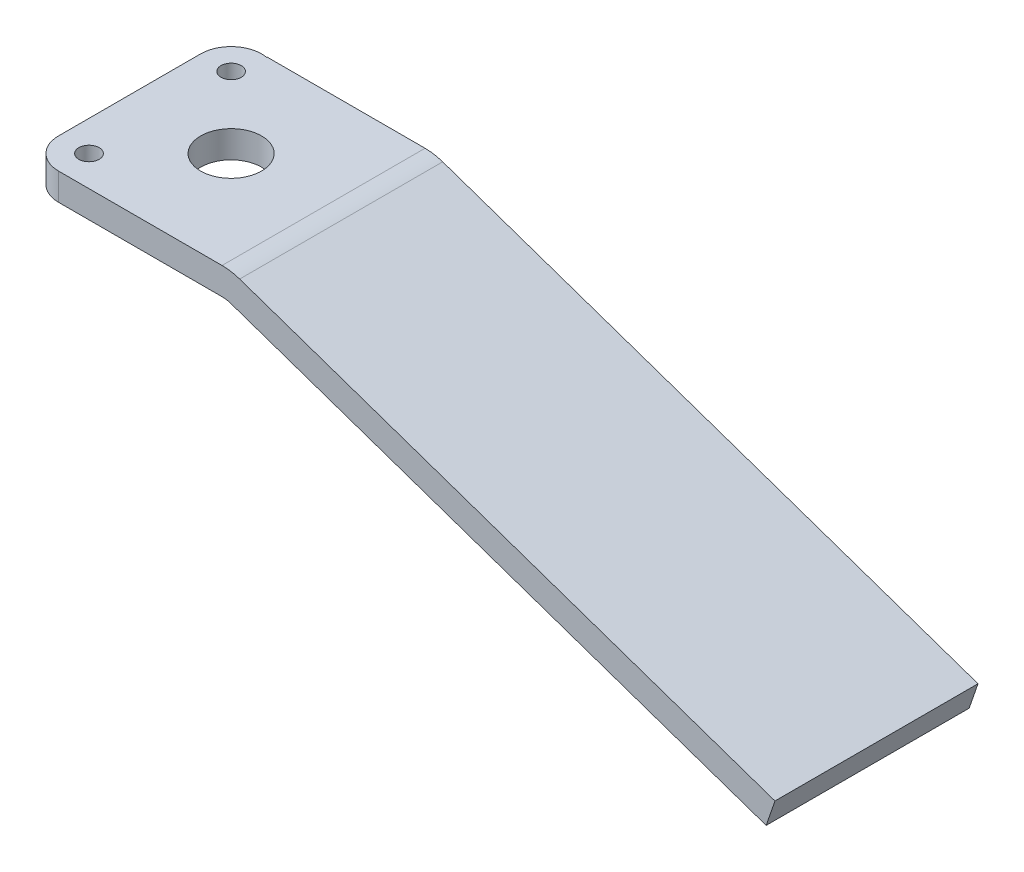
ISO-10303-21;
HEADER;
FILE_DESCRIPTION(('STEP AP214'),'2;1');
FILE_NAME('part.step','',(''),(''),'','','');
FILE_SCHEMA(('AUTOMOTIVE_DESIGN { 1 0 10303 214 1 1 1 1 }'));
ENDSEC;
DATA;
#1=APPLICATION_CONTEXT('core data for automotive mechanical design processes');
#2=APPLICATION_PROTOCOL_DEFINITION('international standard','automotive_design',2000,#1);
#3=PRODUCT_CONTEXT('',#1,'mechanical');
#4=PRODUCT('Part','Part','',(#3));
#5=PRODUCT_RELATED_PRODUCT_CATEGORY('part','',(#4));
#6=PRODUCT_DEFINITION_FORMATION('','',#4);
#7=PRODUCT_DEFINITION_CONTEXT('part definition',#1,'design');
#8=PRODUCT_DEFINITION('design','',#6,#7);
#9=PRODUCT_DEFINITION_SHAPE('','',#8);
#10=(LENGTH_UNIT() NAMED_UNIT(*) SI_UNIT(.MILLI.,.METRE.));
#11=(NAMED_UNIT(*) PLANE_ANGLE_UNIT() SI_UNIT($,.RADIAN.));
#12=(NAMED_UNIT(*) SI_UNIT($,.STERADIAN.) SOLID_ANGLE_UNIT());
#13=UNCERTAINTY_MEASURE_WITH_UNIT(LENGTH_MEASURE(1.E-05),#10,'distance_accuracy_value','');
#14=(GEOMETRIC_REPRESENTATION_CONTEXT(3) GLOBAL_UNCERTAINTY_ASSIGNED_CONTEXT((#13)) GLOBAL_UNIT_ASSIGNED_CONTEXT((#10,
#11,#12)) REPRESENTATION_CONTEXT('',''));
#15=CARTESIAN_POINT('',(0.,0.,0.));
#16=DIRECTION('',(0.,0.,1.));
#17=DIRECTION('',(1.,0.,0.));
#18=AXIS2_PLACEMENT_3D('',#15,#16,#17);
#19=CARTESIAN_POINT('',(-14.3306295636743,0.,15.));
#20=DIRECTION('',(1.,0.,0.));
#21=DIRECTION('',(0.,0.,-1.));
#22=AXIS2_PLACEMENT_3D('',#19,#20,#21);
#23=PLANE('',#22);
#24=DIRECTION('',(0.,1.,0.));
#25=VECTOR('',#24,1.);
#26=CARTESIAN_POINT('',(-14.3306295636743,-31.4553674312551,-10.5));
#27=LINE('',#26,#25);
#28=CARTESIAN_POINT('',(-14.3306295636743,-4.00000000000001,-10.5));
#29=VERTEX_POINT('',#28);
#30=CARTESIAN_POINT('',(-14.3306295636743,0.,-10.5));
#31=VERTEX_POINT('',#30);
#32=EDGE_CURVE('E116',#29,#31,#27,.T.);
#33=ORIENTED_EDGE('',*,*,#32,.F.);
#34=DIRECTION('',(0.,0.,-1.));
#35=VECTOR('',#34,1.);
#36=CARTESIAN_POINT('',(-14.3306295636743,-4.,15.));
#37=LINE('',#36,#35);
#38=CARTESIAN_POINT('',(-14.3306295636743,-4.00000000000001,10.5));
#39=VERTEX_POINT('',#38);
#40=EDGE_CURVE('E37',#39,#29,#37,.T.);
#41=ORIENTED_EDGE('',*,*,#40,.F.);
#42=DIRECTION('',(0.,1.,0.));
#43=VECTOR('',#42,1.);
#44=CARTESIAN_POINT('',(-14.3306295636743,-31.4553674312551,10.5));
#45=LINE('',#44,#43);
#46=CARTESIAN_POINT('',(-14.3306295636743,0.,10.5));
#47=VERTEX_POINT('',#46);
#48=EDGE_CURVE('E282',#39,#47,#45,.T.);
#49=ORIENTED_EDGE('',*,*,#48,.T.);
#50=DIRECTION('',(0.,0.,-1.));
#51=VECTOR('',#50,1.);
#52=CARTESIAN_POINT('',(-14.3306295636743,0.,15.));
#53=LINE('',#52,#51);
#54=EDGE_CURVE('E231',#47,#31,#53,.T.);
#55=ORIENTED_EDGE('',*,*,#54,.T.);
#56=EDGE_LOOP('',(#33,#41,#49,#55));
#57=FACE_BOUND('',#56,.T.);
#58=ADVANCED_FACE('F30',(#57),#23,.F.);
#59=CARTESIAN_POINT('',(14.3306295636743,-4.,15.));
#60=DIRECTION('',(0.,-1.,0.));
#61=DIRECTION('',(1.,0.,0.));
#62=AXIS2_PLACEMENT_3D('',#59,#60,#61);
#63=PLANE('',#62);
#64=CARTESIAN_POINT('',(0.669370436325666,-4.,0.));
#65=DIRECTION('',(0.,-1.,0.));
#66=DIRECTION('',(1.,0.,0.));
#67=AXIS2_PLACEMENT_3D('',#64,#65,#66);
#68=CIRCLE('',#67,4.5);
#69=CARTESIAN_POINT('',(5.16937043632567,-4.,0.));
#70=VERTEX_POINT('',#69);
#71=EDGE_CURVE('E203',#70,#70,#68,.T.);
#72=ORIENTED_EDGE('',*,*,#71,.F.);
#73=EDGE_LOOP('',(#72));
#74=FACE_BOUND('',#73,.T.);
#75=CARTESIAN_POINT('',(-9.83062956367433,-4.,10.5));
#76=DIRECTION('',(0.,-1.,0.));
#77=DIRECTION('',(1.,0.,0.));
#78=AXIS2_PLACEMENT_3D('',#75,#76,#77);
#79=CIRCLE('',#78,1.5);
#80=CARTESIAN_POINT('',(-8.33062956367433,-4.,10.5));
#81=VERTEX_POINT('',#80);
#82=EDGE_CURVE('E207',#81,#81,#79,.T.);
#83=ORIENTED_EDGE('',*,*,#82,.F.);
#84=EDGE_LOOP('',(#83));
#85=FACE_BOUND('',#84,.T.);
#86=CARTESIAN_POINT('',(-9.83062956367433,-4.,-10.5));
#87=DIRECTION('',(0.,-1.,0.));
#88=DIRECTION('',(1.,0.,0.));
#89=AXIS2_PLACEMENT_3D('',#86,#87,#88);
#90=CIRCLE('',#89,1.5);
#91=CARTESIAN_POINT('',(-8.33062956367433,-4.,-10.5));
#92=VERTEX_POINT('',#91);
#93=EDGE_CURVE('E211',#92,#92,#90,.T.);
#94=ORIENTED_EDGE('',*,*,#93,.F.);
#95=EDGE_LOOP('',(#94));
#96=FACE_BOUND('',#95,.T.);
#97=ORIENTED_EDGE('',*,*,#40,.T.);
#98=CARTESIAN_POINT('',(-9.83062956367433,-4.,-10.5));
#99=DIRECTION('',(0.,-1.,0.));
#100=DIRECTION('',(1.,0.,0.));
#101=AXIS2_PLACEMENT_3D('',#98,#99,#100);
#102=CIRCLE('',#101,4.5);
#103=CARTESIAN_POINT('',(-8.90100355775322,-4.00000000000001,-14.9029303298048));
#104=VERTEX_POINT('',#103);
#105=EDGE_CURVE('E214',#29,#104,#102,.T.);
#106=ORIENTED_EDGE('',*,*,#105,.T.);
#107=CARTESIAN_POINT('',(-14.3306295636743,-4.,-10.5));
#108=CARTESIAN_POINT('',(-16.5252141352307,-4.,-14.3200295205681));
#109=CARTESIAN_POINT('',(-21.0852108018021,-4.00000000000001,-22.2574415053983));
#110=CARTESIAN_POINT('',(-13.062587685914,-4.,-17.4149047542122));
#111=CARTESIAN_POINT('',(-8.90100355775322,-4.,-14.9029303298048));
#112=B_SPLINE_CURVE_WITH_KNOTS('',3,(#107,#108,#109,#110,#111),.UNSPECIFIED.,.F.,.F.,(4,1,4),
(0.,0.481268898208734,1.),.UNSPECIFIED.);
#113=CARTESIAN_POINT('',(-9.06182367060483,-4.,-15.));
#114=VERTEX_POINT('',#113);
#115=EDGE_CURVE('E124',#104,#114,#112,.F.);
#116=ORIENTED_EDGE('',*,*,#115,.T.);
#117=DIRECTION('',(-1.,0.,0.));
#118=VECTOR('',#117,1.);
#119=CARTESIAN_POINT('',(14.3306295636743,-4.,-15.));
#120=LINE('',#119,#118);
#121=CARTESIAN_POINT('',(14.3306295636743,-4.,-15.));
#122=VERTEX_POINT('',#121);
#123=EDGE_CURVE('E266',#122,#114,#120,.T.);
#124=ORIENTED_EDGE('',*,*,#123,.F.);
#125=DIRECTION('',(0.,0.,-1.));
#126=VECTOR('',#125,1.);
#127=CARTESIAN_POINT('',(14.3306295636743,-4.,15.));
#128=LINE('',#127,#126);
#129=CARTESIAN_POINT('',(14.3306295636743,-4.,15.));
#130=VERTEX_POINT('',#129);
#131=EDGE_CURVE('E217',#130,#122,#128,.T.);
#132=ORIENTED_EDGE('',*,*,#131,.F.);
#133=DIRECTION('',(-1.,0.,0.));
#134=VECTOR('',#133,1.);
#135=CARTESIAN_POINT('',(14.3306295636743,-4.,15.));
#136=LINE('',#135,#134);
#137=CARTESIAN_POINT('',(-9.83062956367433,-4.,15.));
#138=VERTEX_POINT('',#137);
#139=EDGE_CURVE('E249',#130,#138,#136,.T.);
#140=ORIENTED_EDGE('',*,*,#139,.T.);
#141=CARTESIAN_POINT('',(-9.83062956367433,-4.,10.5));
#142=DIRECTION('',(0.,-1.,0.));
#143=DIRECTION('',(1.,0.,0.));
#144=AXIS2_PLACEMENT_3D('',#141,#142,#143);
#145=CIRCLE('',#144,4.5);
#146=EDGE_CURVE('E51',#138,#39,#145,.T.);
#147=ORIENTED_EDGE('',*,*,#146,.T.);
#148=EDGE_LOOP('',(#97,#106,#116,#124,#132,#140,#147));
#149=FACE_BOUND('',#148,.T.);
#150=ADVANCED_FACE('F175',(#74,#85,#96,#149),#63,.T.);
#151=CARTESIAN_POINT('',(-14.3306295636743,0.,15.));
#152=DIRECTION('',(0.,1.,0.));
#153=DIRECTION('',(-1.,0.,0.));
#154=AXIS2_PLACEMENT_3D('',#151,#152,#153);
#155=PLANE('',#154);
#156=CARTESIAN_POINT('',(0.669370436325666,0.,0.));
#157=DIRECTION('',(0.,1.,0.));
#158=DIRECTION('',(-1.,0.,0.));
#159=AXIS2_PLACEMENT_3D('',#156,#157,#158);
#160=CIRCLE('',#159,4.5);
#161=CARTESIAN_POINT('',(-3.83062956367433,0.,0.));
#162=VERTEX_POINT('',#161);
#163=EDGE_CURVE('E270',#162,#162,#160,.T.);
#164=ORIENTED_EDGE('',*,*,#163,.F.);
#165=EDGE_LOOP('',(#164));
#166=FACE_BOUND('',#165,.T.);
#167=CARTESIAN_POINT('',(-9.83062956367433,0.,10.5));
#168=DIRECTION('',(0.,1.,0.));
#169=DIRECTION('',(-1.,0.,0.));
#170=AXIS2_PLACEMENT_3D('',#167,#168,#169);
#171=CIRCLE('',#170,1.5);
#172=CARTESIAN_POINT('',(-11.3306295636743,0.,10.5));
#173=VERTEX_POINT('',#172);
#174=EDGE_CURVE('E274',#173,#173,#171,.T.);
#175=ORIENTED_EDGE('',*,*,#174,.F.);
#176=EDGE_LOOP('',(#175));
#177=FACE_BOUND('',#176,.T.);
#178=CARTESIAN_POINT('',(-9.83062956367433,0.,-10.5));
#179=DIRECTION('',(0.,1.,0.));
#180=DIRECTION('',(-1.,0.,0.));
#181=AXIS2_PLACEMENT_3D('',#178,#179,#180);
#182=CIRCLE('',#181,1.5);
#183=CARTESIAN_POINT('',(-11.3306295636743,0.,-10.5));
#184=VERTEX_POINT('',#183);
#185=EDGE_CURVE('E278',#184,#184,#182,.T.);
#186=ORIENTED_EDGE('',*,*,#185,.F.);
#187=EDGE_LOOP('',(#186));
#188=FACE_BOUND('',#187,.T.);
#189=CARTESIAN_POINT('',(-14.3306295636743,0.,-10.5));
#190=CARTESIAN_POINT('',(-16.5252141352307,0.,-14.3200295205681));
#191=CARTESIAN_POINT('',(-21.0852108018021,0.,-22.2574415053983));
#192=CARTESIAN_POINT('',(-13.062587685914,0.,-17.4149047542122));
#193=CARTESIAN_POINT('',(-8.90100355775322,0.,-14.9029303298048));
#194=B_SPLINE_CURVE_WITH_KNOTS('',3,(#189,#190,#191,#192,#193),.UNSPECIFIED.,.F.,.F.,(4,1,4),
(0.,0.481268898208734,1.),.UNSPECIFIED.);
#195=CARTESIAN_POINT('',(-9.0618236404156,0.,-15.));
#196=VERTEX_POINT('',#195);
#197=CARTESIAN_POINT('',(-8.90100355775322,0.,-14.9029303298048));
#198=VERTEX_POINT('',#197);
#199=EDGE_CURVE('E43',#196,#198,#194,.T.);
#200=ORIENTED_EDGE('',*,*,#199,.T.);
#201=CARTESIAN_POINT('',(-9.83062956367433,0.,-10.5));
#202=DIRECTION('',(0.,1.,0.));
#203=DIRECTION('',(-1.,0.,0.));
#204=AXIS2_PLACEMENT_3D('',#201,#202,#203);
#205=CIRCLE('',#204,4.5);
#206=EDGE_CURVE('E112',#198,#31,#205,.T.);
#207=ORIENTED_EDGE('',*,*,#206,.T.);
#208=ORIENTED_EDGE('',*,*,#54,.F.);
#209=CARTESIAN_POINT('',(-9.83062956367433,0.,10.5));
#210=DIRECTION('',(0.,1.,0.));
#211=DIRECTION('',(-1.,0.,0.));
#212=AXIS2_PLACEMENT_3D('',#209,#210,#211);
#213=CIRCLE('',#212,4.5);
#214=CARTESIAN_POINT('',(-9.83062956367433,0.,15.));
#215=VERTEX_POINT('',#214);
#216=EDGE_CURVE('E286',#47,#215,#213,.T.);
#217=ORIENTED_EDGE('',*,*,#216,.T.);
#218=DIRECTION('',(1.,0.,0.));
#219=VECTOR('',#218,1.);
#220=CARTESIAN_POINT('',(-14.3306295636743,0.,15.));
#221=LINE('',#220,#219);
#222=CARTESIAN_POINT('',(14.3306295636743,0.,15.));
#223=VERTEX_POINT('',#222);
#224=EDGE_CURVE('E233',#215,#223,#221,.T.);
#225=ORIENTED_EDGE('',*,*,#224,.T.);
#226=DIRECTION('',(0.,0.,-1.));
#227=VECTOR('',#226,1.);
#228=CARTESIAN_POINT('',(14.3306295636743,0.,15.));
#229=LINE('',#228,#227);
#230=CARTESIAN_POINT('',(14.3306295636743,0.,-15.));
#231=VERTEX_POINT('',#230);
#232=EDGE_CURVE('E229',#223,#231,#229,.T.);
#233=ORIENTED_EDGE('',*,*,#232,.T.);
#234=DIRECTION('',(1.,0.,0.));
#235=VECTOR('',#234,1.);
#236=CARTESIAN_POINT('',(-14.3306295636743,0.,-15.));
#237=LINE('',#236,#235);
#238=EDGE_CURVE('E129',#196,#231,#237,.T.);
#239=ORIENTED_EDGE('',*,*,#238,.F.);
#240=EDGE_LOOP('',(#200,#207,#208,#217,#225,#233,#239));
#241=FACE_BOUND('',#240,.T.);
#242=ADVANCED_FACE('F127',(#166,#177,#188,#241),#155,.T.);
#243=CARTESIAN_POINT('',(14.3306295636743,-8.00000000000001,-15.));
#244=DIRECTION('',(0.,0.,1.));
#245=DIRECTION('',(1.,0.,0.));
#246=AXIS2_PLACEMENT_3D('',#243,#244,#245);
#247=PLANE('',#246);
#248=DIRECTION('',(0.,1.,0.));
#249=VECTOR('',#248,1.);
#250=CARTESIAN_POINT('',(-9.06182367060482,-31.4553674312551,-15.));
#251=LINE('',#250,#249);
#252=EDGE_CURVE('E11',#196,#114,#251,.F.);
#253=ORIENTED_EDGE('',*,*,#252,.F.);
#254=ORIENTED_EDGE('',*,*,#238,.T.);
#255=CARTESIAN_POINT('',(14.3306295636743,-8.,-15.));
#256=DIRECTION('',(0.,0.,1.));
#257=DIRECTION('',(1.,0.,0.));
#258=AXIS2_PLACEMENT_3D('',#255,#256,#257);
#259=CIRCLE('',#258,8.);
#260=CARTESIAN_POINT('',(16.9351747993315,-0.435851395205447,-15.));
#261=VERTEX_POINT('',#260);
#262=EDGE_CURVE('E252',#261,#231,#259,.T.);
#263=ORIENTED_EDGE('',*,*,#262,.F.);
#264=DIRECTION('',(0.945518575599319,-0.325568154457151,0.));
#265=VECTOR('',#264,1.);
#266=CARTESIAN_POINT('',(16.9351747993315,-0.435851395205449,-15.));
#267=LINE('',#266,#265);
#268=CARTESIAN_POINT('',(96.0384493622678,-27.6732931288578,-15.));
#269=VERTEX_POINT('',#268);
#270=EDGE_CURVE('E255',#261,#269,#267,.T.);
#271=ORIENTED_EDGE('',*,*,#270,.T.);
#272=DIRECTION('',(-0.32556815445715,-0.945518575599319,0.));
#273=VECTOR('',#272,1.);
#274=CARTESIAN_POINT('',(96.0384493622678,-27.6732931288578,-15.));
#275=LINE('',#274,#273);
#276=CARTESIAN_POINT('',(94.7361767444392,-31.4553674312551,-15.));
#277=VERTEX_POINT('',#276);
#278=EDGE_CURVE('E257',#269,#277,#275,.T.);
#279=ORIENTED_EDGE('',*,*,#278,.T.);
#280=DIRECTION('',(0.945518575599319,-0.325568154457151,0.));
#281=VECTOR('',#280,1.);
#282=CARTESIAN_POINT('',(15.6329021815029,-4.21792569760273,-15.));
#283=LINE('',#282,#281);
#284=CARTESIAN_POINT('',(15.6329021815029,-4.21792569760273,-15.));
#285=VERTEX_POINT('',#284);
#286=EDGE_CURVE('E260',#285,#277,#283,.T.);
#287=ORIENTED_EDGE('',*,*,#286,.F.);
#288=CARTESIAN_POINT('',(14.3306295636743,-8.00000000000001,-15.));
#289=DIRECTION('',(0.,0.,1.));
#290=DIRECTION('',(1.,0.,0.));
#291=AXIS2_PLACEMENT_3D('',#288,#289,#290);
#292=CIRCLE('',#291,4.);
#293=EDGE_CURVE('E263',#285,#122,#292,.T.);
#294=ORIENTED_EDGE('',*,*,#293,.T.);
#295=ORIENTED_EDGE('',*,*,#123,.T.);
#296=EDGE_LOOP('',(#253,#254,#263,#271,#279,#287,#294,#295));
#297=FACE_BOUND('',#296,.T.);
#298=ADVANCED_FACE('F164',(#297),#247,.F.);
#299=CARTESIAN_POINT('',(14.3306295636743,-8.00000000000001,15.));
#300=DIRECTION('',(0.,0.,-1.));
#301=DIRECTION('',(-1.,0.,0.));
#302=AXIS2_PLACEMENT_3D('',#299,#300,#301);
#303=CYLINDRICAL_SURFACE('',#302,4.);
#304=ORIENTED_EDGE('',*,*,#293,.F.);
#305=DIRECTION('',(0.,0.,-1.));
#306=VECTOR('',#305,1.);
#307=CARTESIAN_POINT('',(15.6329021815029,-4.21792569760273,15.));
#308=LINE('',#307,#306);
#309=CARTESIAN_POINT('',(15.6329021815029,-4.21792569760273,15.));
#310=VERTEX_POINT('',#309);
#311=EDGE_CURVE('E218',#310,#285,#308,.T.);
#312=ORIENTED_EDGE('',*,*,#311,.F.);
#313=CARTESIAN_POINT('',(14.3306295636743,-8.00000000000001,15.));
#314=DIRECTION('',(0.,0.,1.));
#315=DIRECTION('',(1.,0.,0.));
#316=AXIS2_PLACEMENT_3D('',#313,#314,#315);
#317=CIRCLE('',#316,4.);
#318=EDGE_CURVE('E246',#310,#130,#317,.T.);
#319=ORIENTED_EDGE('',*,*,#318,.T.);
#320=ORIENTED_EDGE('',*,*,#131,.T.);
#321=EDGE_LOOP('',(#304,#312,#319,#320));
#322=FACE_BOUND('',#321,.T.);
#323=ADVANCED_FACE('F167',(#322),#303,.F.);
#324=CARTESIAN_POINT('',(15.6329021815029,-4.21792569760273,15.));
#325=DIRECTION('',(0.325568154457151,0.945518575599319,0.));
#326=DIRECTION('',(-0.945518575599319,0.325568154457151,0.));
#327=AXIS2_PLACEMENT_3D('',#324,#325,#326);
#328=PLANE('',#327);
#329=ORIENTED_EDGE('',*,*,#286,.T.);
#330=DIRECTION('',(0.,0.,-1.));
#331=VECTOR('',#330,1.);
#332=CARTESIAN_POINT('',(94.7361767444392,-31.4553674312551,15.));
#333=LINE('',#332,#331);
#334=CARTESIAN_POINT('',(94.7361767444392,-31.4553674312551,15.));
#335=VERTEX_POINT('',#334);
#336=EDGE_CURVE('E222',#335,#277,#333,.T.);
#337=ORIENTED_EDGE('',*,*,#336,.F.);
#338=DIRECTION('',(0.945518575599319,-0.325568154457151,0.));
#339=VECTOR('',#338,1.);
#340=CARTESIAN_POINT('',(15.6329021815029,-4.21792569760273,15.));
#341=LINE('',#340,#339);
#342=EDGE_CURVE('E244',#310,#335,#341,.T.);
#343=ORIENTED_EDGE('',*,*,#342,.F.);
#344=ORIENTED_EDGE('',*,*,#311,.T.);
#345=EDGE_LOOP('',(#329,#337,#343,#344));
#346=FACE_BOUND('',#345,.T.);
#347=ADVANCED_FACE('F187',(#346),#328,.F.);
#348=CARTESIAN_POINT('',(96.0384493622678,-27.6732931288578,15.));
#349=DIRECTION('',(0.945518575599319,-0.32556815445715,0.));
#350=DIRECTION('',(0.32556815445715,0.945518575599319,0.));
#351=AXIS2_PLACEMENT_3D('',#348,#349,#350);
#352=PLANE('',#351);
#353=ORIENTED_EDGE('',*,*,#278,.F.);
#354=DIRECTION('',(0.,0.,-1.));
#355=VECTOR('',#354,1.);
#356=CARTESIAN_POINT('',(96.0384493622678,-27.6732931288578,15.));
#357=LINE('',#356,#355);
#358=CARTESIAN_POINT('',(96.0384493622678,-27.6732931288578,15.));
#359=VERTEX_POINT('',#358);
#360=EDGE_CURVE('E224',#359,#269,#357,.T.);
#361=ORIENTED_EDGE('',*,*,#360,.F.);
#362=DIRECTION('',(-0.32556815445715,-0.945518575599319,0.));
#363=VECTOR('',#362,1.);
#364=CARTESIAN_POINT('',(96.0384493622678,-27.6732931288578,15.));
#365=LINE('',#364,#363);
#366=EDGE_CURVE('E241',#359,#335,#365,.T.);
#367=ORIENTED_EDGE('',*,*,#366,.T.);
#368=ORIENTED_EDGE('',*,*,#336,.T.);
#369=EDGE_LOOP('',(#353,#361,#367,#368));
#370=FACE_BOUND('',#369,.T.);
#371=ADVANCED_FACE('F183',(#370),#352,.T.);
#372=CARTESIAN_POINT('',(16.9351747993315,-0.435851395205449,15.));
#373=DIRECTION('',(0.325568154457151,0.945518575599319,0.));
#374=DIRECTION('',(-0.945518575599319,0.325568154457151,0.));
#375=AXIS2_PLACEMENT_3D('',#372,#373,#374);
#376=PLANE('',#375);
#377=ORIENTED_EDGE('',*,*,#270,.F.);
#378=DIRECTION('',(0.,0.,-1.));
#379=VECTOR('',#378,1.);
#380=CARTESIAN_POINT('',(16.9351747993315,-0.435851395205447,15.));
#381=LINE('',#380,#379);
#382=CARTESIAN_POINT('',(16.9351747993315,-0.435851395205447,15.));
#383=VERTEX_POINT('',#382);
#384=EDGE_CURVE('E227',#383,#261,#381,.T.);
#385=ORIENTED_EDGE('',*,*,#384,.F.);
#386=DIRECTION('',(0.945518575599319,-0.325568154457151,0.));
#387=VECTOR('',#386,1.);
#388=CARTESIAN_POINT('',(84.9309322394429,-23.8486682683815,15.));
#389=LINE('',#388,#387);
#390=EDGE_CURVE('E238',#383,#359,#389,.T.);
#391=ORIENTED_EDGE('',*,*,#390,.T.);
#392=ORIENTED_EDGE('',*,*,#360,.T.);
#393=EDGE_LOOP('',(#377,#385,#391,#392));
#394=FACE_BOUND('',#393,.T.);
#395=ADVANCED_FACE('F179',(#394),#376,.T.);
#396=CARTESIAN_POINT('',(14.3306295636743,-8.,15.));
#397=DIRECTION('',(0.,0.,-1.));
#398=DIRECTION('',(-1.,0.,0.));
#399=AXIS2_PLACEMENT_3D('',#396,#397,#398);
#400=CYLINDRICAL_SURFACE('',#399,8.);
#401=ORIENTED_EDGE('',*,*,#262,.T.);
#402=ORIENTED_EDGE('',*,*,#232,.F.);
#403=CARTESIAN_POINT('',(14.3306295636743,-8.,15.));
#404=DIRECTION('',(0.,0.,1.));
#405=DIRECTION('',(1.,0.,0.));
#406=AXIS2_PLACEMENT_3D('',#403,#404,#405);
#407=CIRCLE('',#406,8.);
#408=EDGE_CURVE('E235',#383,#223,#407,.T.);
#409=ORIENTED_EDGE('',*,*,#408,.F.);
#410=ORIENTED_EDGE('',*,*,#384,.T.);
#411=EDGE_LOOP('',(#401,#402,#409,#410));
#412=FACE_BOUND('',#411,.T.);
#413=ADVANCED_FACE('F171',(#412),#400,.T.);
#414=CARTESIAN_POINT('',(14.3306295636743,-8.00000000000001,15.));
#415=DIRECTION('',(0.,0.,1.));
#416=DIRECTION('',(1.,0.,0.));
#417=AXIS2_PLACEMENT_3D('',#414,#415,#416);
#418=PLANE('',#417);
#419=DIRECTION('',(0.,1.,0.));
#420=VECTOR('',#419,1.);
#421=CARTESIAN_POINT('',(-9.83062956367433,-31.4553674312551,15.));
#422=LINE('',#421,#420);
#423=EDGE_CURVE('E284',#138,#215,#422,.T.);
#424=ORIENTED_EDGE('',*,*,#423,.F.);
#425=ORIENTED_EDGE('',*,*,#139,.F.);
#426=ORIENTED_EDGE('',*,*,#318,.F.);
#427=ORIENTED_EDGE('',*,*,#342,.T.);
#428=ORIENTED_EDGE('',*,*,#366,.F.);
#429=ORIENTED_EDGE('',*,*,#390,.F.);
#430=ORIENTED_EDGE('',*,*,#408,.T.);
#431=ORIENTED_EDGE('',*,*,#224,.F.);
#432=EDGE_LOOP('',(#424,#425,#426,#427,#428,#429,#430,#431));
#433=FACE_BOUND('',#432,.T.);
#434=ADVANCED_FACE('F162',(#433),#418,.T.);
#435=CARTESIAN_POINT('',(0.669370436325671,-31.4553674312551,0.));
#436=DIRECTION('',(0.,1.,0.));
#437=DIRECTION('',(-1.,0.,0.));
#438=AXIS2_PLACEMENT_3D('',#435,#436,#437);
#439=CYLINDRICAL_SURFACE('',#438,4.5);
#440=ORIENTED_EDGE('',*,*,#71,.T.);
#441=EDGE_LOOP('',(#440));
#442=FACE_BOUND('',#441,.T.);
#443=ORIENTED_EDGE('',*,*,#163,.T.);
#444=EDGE_LOOP('',(#443));
#445=FACE_BOUND('',#444,.T.);
#446=ADVANCED_FACE('F158',(#442,#445),#439,.F.);
#447=CARTESIAN_POINT('',(-9.83062956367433,-31.4553674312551,10.5));
#448=DIRECTION('',(0.,1.,0.));
#449=DIRECTION('',(-1.,0.,0.));
#450=AXIS2_PLACEMENT_3D('',#447,#448,#449);
#451=CYLINDRICAL_SURFACE('',#450,1.5);
#452=ORIENTED_EDGE('',*,*,#82,.T.);
#453=EDGE_LOOP('',(#452));
#454=FACE_BOUND('',#453,.T.);
#455=ORIENTED_EDGE('',*,*,#174,.T.);
#456=EDGE_LOOP('',(#455));
#457=FACE_BOUND('',#456,.T.);
#458=ADVANCED_FACE('F154',(#454,#457),#451,.F.);
#459=CARTESIAN_POINT('',(-9.83062956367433,-31.4553674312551,-10.5));
#460=DIRECTION('',(0.,1.,0.));
#461=DIRECTION('',(-1.,0.,0.));
#462=AXIS2_PLACEMENT_3D('',#459,#460,#461);
#463=CYLINDRICAL_SURFACE('',#462,1.5);
#464=ORIENTED_EDGE('',*,*,#93,.T.);
#465=EDGE_LOOP('',(#464));
#466=FACE_BOUND('',#465,.T.);
#467=ORIENTED_EDGE('',*,*,#185,.T.);
#468=EDGE_LOOP('',(#467));
#469=FACE_BOUND('',#468,.T.);
#470=ADVANCED_FACE('F151',(#466,#469),#463,.F.);
#471=CARTESIAN_POINT('',(-9.83062956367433,-31.4553674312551,10.5));
#472=DIRECTION('',(0.,1.,0.));
#473=DIRECTION('',(-1.,0.,0.));
#474=AXIS2_PLACEMENT_3D('',#471,#472,#473);
#475=CYLINDRICAL_SURFACE('',#474,4.5);
#476=ORIENTED_EDGE('',*,*,#423,.T.);
#477=ORIENTED_EDGE('',*,*,#216,.F.);
#478=ORIENTED_EDGE('',*,*,#48,.F.);
#479=ORIENTED_EDGE('',*,*,#146,.F.);
#480=EDGE_LOOP('',(#476,#477,#478,#479));
#481=FACE_BOUND('',#480,.T.);
#482=ADVANCED_FACE('F148',(#481),#475,.T.);
#483=CARTESIAN_POINT('',(-9.83062956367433,-31.4553674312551,-10.5));
#484=DIRECTION('',(0.,1.,0.));
#485=DIRECTION('',(-1.,0.,0.));
#486=AXIS2_PLACEMENT_3D('',#483,#484,#485);
#487=CYLINDRICAL_SURFACE('',#486,4.5);
#488=ORIENTED_EDGE('',*,*,#32,.T.);
#489=ORIENTED_EDGE('',*,*,#206,.F.);
#490=DIRECTION('',(0.,1.,0.));
#491=VECTOR('',#490,1.);
#492=CARTESIAN_POINT('',(-8.90100355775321,-31.4553674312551,-14.9029303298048));
#493=LINE('',#492,#491);
#494=EDGE_CURVE('E114',#104,#198,#493,.T.);
#495=ORIENTED_EDGE('',*,*,#494,.F.);
#496=ORIENTED_EDGE('',*,*,#105,.F.);
#497=EDGE_LOOP('',(#488,#489,#495,#496));
#498=FACE_BOUND('',#497,.T.);
#499=ADVANCED_FACE('F113',(#498),#487,.T.);
#500=CARTESIAN_POINT('',(-14.3306295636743,-31.4553674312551,-10.5));
#501=CARTESIAN_POINT('',(-16.5252141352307,-31.4553674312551,-14.3200295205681));
#502=CARTESIAN_POINT('',(-21.0852108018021,-31.4553674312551,-22.2574415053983));
#503=CARTESIAN_POINT('',(-13.062587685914,-31.4553674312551,-17.4149047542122));
#504=CARTESIAN_POINT('',(-8.90100355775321,-31.4553674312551,-14.9029303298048));
#505=B_SPLINE_CURVE_WITH_KNOTS('',3,(#500,#501,#502,#503,#504),.UNSPECIFIED.,.F.,.F.,(4,1,4),
(0.,0.481268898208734,1.),.UNSPECIFIED.);
#506=DIRECTION('',(0.,1.,0.));
#507=VECTOR('',#506,1.);
#508=SURFACE_OF_LINEAR_EXTRUSION('',#505,#507);
#509=ORIENTED_EDGE('',*,*,#494,.T.);
#510=ORIENTED_EDGE('',*,*,#199,.F.);
#511=ORIENTED_EDGE('',*,*,#252,.T.);
#512=ORIENTED_EDGE('',*,*,#115,.F.);
#513=EDGE_LOOP('',(#509,#510,#511,#512));
#514=FACE_BOUND('',#513,.T.);
#515=ADVANCED_FACE('F122',(#514),#508,.T.);
#516=CLOSED_SHELL('',(#58,#150,#242,#298,#323,#347,#371,#395,#413,#434,#446,#458,#470,#482,#499,#515));
#517=MANIFOLD_SOLID_BREP('B2',#516);
#518=ADVANCED_BREP_SHAPE_REPRESENTATION('',(#18,#517),#14);
#519=SHAPE_DEFINITION_REPRESENTATION(#9,#518);
ENDSEC;
END-ISO-10303-21;
